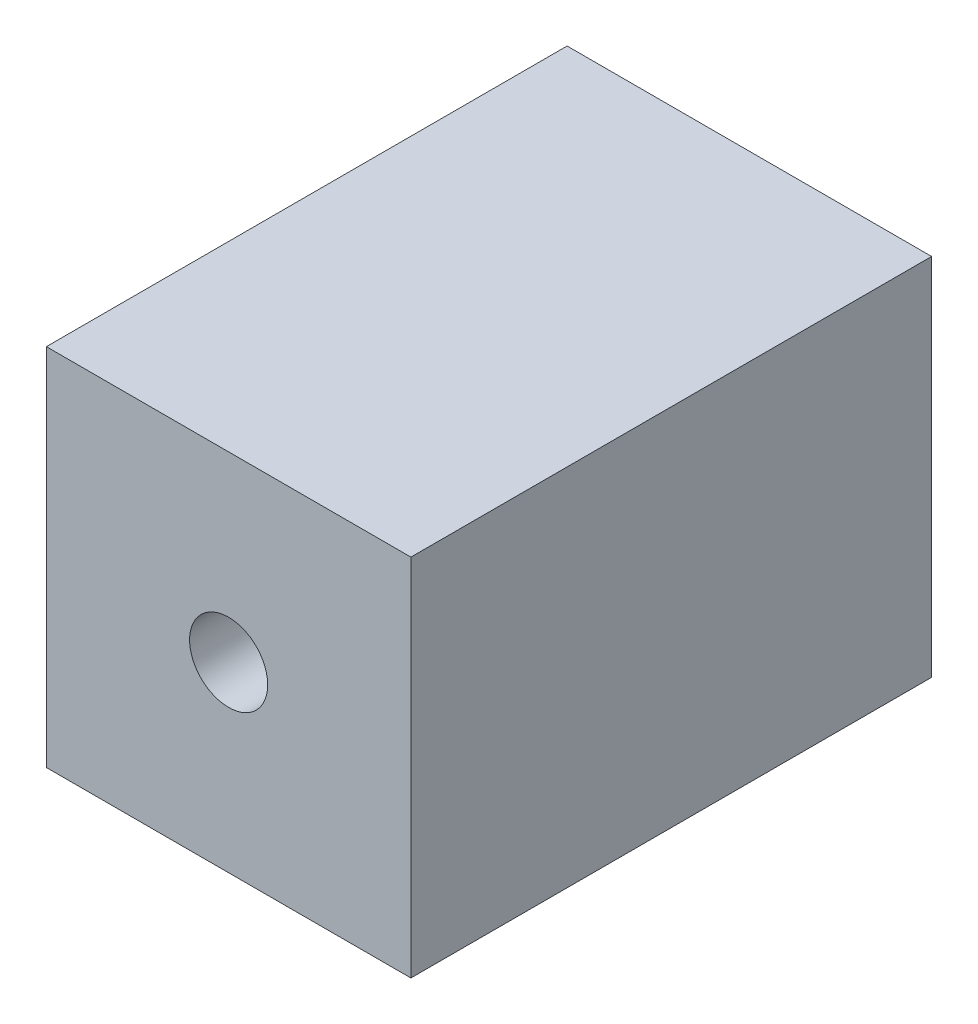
ISO-10303-21;
HEADER;
FILE_DESCRIPTION(('STEP AP214'),'2;1');
FILE_NAME('part.step','',(''),(''),'','','');
FILE_SCHEMA(('AUTOMOTIVE_DESIGN { 1 0 10303 214 1 1 1 1 }'));
ENDSEC;
DATA;
#1=APPLICATION_CONTEXT('core data for automotive mechanical design processes');
#2=APPLICATION_PROTOCOL_DEFINITION('international standard','automotive_design',2000,#1);
#3=PRODUCT_CONTEXT('',#1,'mechanical');
#4=PRODUCT('Part','Part','',(#3));
#5=PRODUCT_RELATED_PRODUCT_CATEGORY('part','',(#4));
#6=PRODUCT_DEFINITION_FORMATION('','',#4);
#7=PRODUCT_DEFINITION_CONTEXT('part definition',#1,'design');
#8=PRODUCT_DEFINITION('design','',#6,#7);
#9=PRODUCT_DEFINITION_SHAPE('','',#8);
#10=(LENGTH_UNIT() NAMED_UNIT(*) SI_UNIT(.MILLI.,.METRE.));
#11=(NAMED_UNIT(*) PLANE_ANGLE_UNIT() SI_UNIT($,.RADIAN.));
#12=(NAMED_UNIT(*) SI_UNIT($,.STERADIAN.) SOLID_ANGLE_UNIT());
#13=UNCERTAINTY_MEASURE_WITH_UNIT(LENGTH_MEASURE(1.E-05),#10,'distance_accuracy_value','');
#14=(GEOMETRIC_REPRESENTATION_CONTEXT(3) GLOBAL_UNCERTAINTY_ASSIGNED_CONTEXT((#13)) GLOBAL_UNIT_ASSIGNED_CONTEXT((#10,
#11,#12)) REPRESENTATION_CONTEXT('',''));
#15=CARTESIAN_POINT('',(0.,0.,0.));
#16=DIRECTION('',(0.,0.,1.));
#17=DIRECTION('',(1.,0.,0.));
#18=AXIS2_PLACEMENT_3D('',#15,#16,#17);
#19=CARTESIAN_POINT('',(0.,0.,40.));
#20=DIRECTION('',(0.,0.,-1.));
#21=DIRECTION('',(-1.,0.,0.));
#22=AXIS2_PLACEMENT_3D('',#19,#20,#21);
#23=PLANE('',#22);
#24=DIRECTION('',(0.,1.,0.));
#25=VECTOR('',#24,1.);
#26=CARTESIAN_POINT('',(14.,-14.,40.));
#27=LINE('',#26,#25);
#28=CARTESIAN_POINT('',(14.,-14.,40.));
#29=VERTEX_POINT('',#28);
#30=CARTESIAN_POINT('',(14.,14.,40.));
#31=VERTEX_POINT('',#30);
#32=EDGE_CURVE('E86',#29,#31,#27,.T.);
#33=ORIENTED_EDGE('',*,*,#32,.T.);
#34=DIRECTION('',(-1.,0.,0.));
#35=VECTOR('',#34,1.);
#36=CARTESIAN_POINT('',(-14.,14.,40.));
#37=LINE('',#36,#35);
#38=CARTESIAN_POINT('',(-14.,14.,40.));
#39=VERTEX_POINT('',#38);
#40=EDGE_CURVE('E81',#31,#39,#37,.T.);
#41=ORIENTED_EDGE('',*,*,#40,.T.);
#42=DIRECTION('',(0.,-1.,0.));
#43=VECTOR('',#42,1.);
#44=CARTESIAN_POINT('',(-14.,-14.,40.));
#45=LINE('',#44,#43);
#46=CARTESIAN_POINT('',(-14.,-14.,40.));
#47=VERTEX_POINT('',#46);
#48=EDGE_CURVE('E84',#39,#47,#45,.T.);
#49=ORIENTED_EDGE('',*,*,#48,.T.);
#50=DIRECTION('',(1.,0.,0.));
#51=VECTOR('',#50,1.);
#52=CARTESIAN_POINT('',(-14.,-14.,40.));
#53=LINE('',#52,#51);
#54=EDGE_CURVE('E51',#47,#29,#53,.T.);
#55=ORIENTED_EDGE('',*,*,#54,.T.);
#56=EDGE_LOOP('',(#33,#41,#49,#55));
#57=FACE_BOUND('',#56,.T.);
#58=CARTESIAN_POINT('',(0.,0.,40.));
#59=DIRECTION('',(0.,0.,1.));
#60=DIRECTION('',(1.,0.,0.));
#61=AXIS2_PLACEMENT_3D('',#58,#59,#60);
#62=CIRCLE('',#61,3.);
#63=CARTESIAN_POINT('',(3.,0.,40.));
#64=VERTEX_POINT('',#63);
#65=EDGE_CURVE('E101',#64,#64,#62,.T.);
#66=ORIENTED_EDGE('',*,*,#65,.F.);
#67=EDGE_LOOP('',(#66));
#68=FACE_BOUND('',#67,.T.);
#69=ADVANCED_FACE('F34',(#57,#68),#23,.F.);
#70=CARTESIAN_POINT('',(0.,0.,0.));
#71=DIRECTION('',(0.,0.,-1.));
#72=DIRECTION('',(-1.,0.,0.));
#73=AXIS2_PLACEMENT_3D('',#70,#71,#72);
#74=PLANE('',#73);
#75=DIRECTION('',(0.,1.,0.));
#76=VECTOR('',#75,1.);
#77=CARTESIAN_POINT('',(14.,-14.,0.));
#78=LINE('',#77,#76);
#79=CARTESIAN_POINT('',(14.,-14.,0.));
#80=VERTEX_POINT('',#79);
#81=CARTESIAN_POINT('',(14.,14.,0.));
#82=VERTEX_POINT('',#81);
#83=EDGE_CURVE('E98',#80,#82,#78,.T.);
#84=ORIENTED_EDGE('',*,*,#83,.F.);
#85=DIRECTION('',(1.,0.,0.));
#86=VECTOR('',#85,1.);
#87=CARTESIAN_POINT('',(-14.,-14.,0.));
#88=LINE('',#87,#86);
#89=CARTESIAN_POINT('',(-14.,-14.,0.));
#90=VERTEX_POINT('',#89);
#91=EDGE_CURVE('E74',#90,#80,#88,.T.);
#92=ORIENTED_EDGE('',*,*,#91,.F.);
#93=DIRECTION('',(0.,-1.,0.));
#94=VECTOR('',#93,1.);
#95=CARTESIAN_POINT('',(-14.,-14.,0.));
#96=LINE('',#95,#94);
#97=CARTESIAN_POINT('',(-14.,14.,0.));
#98=VERTEX_POINT('',#97);
#99=EDGE_CURVE('E68',#98,#90,#96,.T.);
#100=ORIENTED_EDGE('',*,*,#99,.F.);
#101=DIRECTION('',(-1.,0.,0.));
#102=VECTOR('',#101,1.);
#103=CARTESIAN_POINT('',(-14.,14.,0.));
#104=LINE('',#103,#102);
#105=EDGE_CURVE('E90',#82,#98,#104,.T.);
#106=ORIENTED_EDGE('',*,*,#105,.F.);
#107=EDGE_LOOP('',(#84,#92,#100,#106));
#108=FACE_BOUND('',#107,.T.);
#109=CARTESIAN_POINT('',(0.,0.,0.));
#110=DIRECTION('',(0.,0.,1.));
#111=DIRECTION('',(1.,0.,0.));
#112=AXIS2_PLACEMENT_3D('',#109,#110,#111);
#113=CIRCLE('',#112,3.);
#114=CARTESIAN_POINT('',(3.,0.,0.));
#115=VERTEX_POINT('',#114);
#116=EDGE_CURVE('E113',#115,#115,#113,.T.);
#117=ORIENTED_EDGE('',*,*,#116,.T.);
#118=EDGE_LOOP('',(#117));
#119=FACE_BOUND('',#118,.T.);
#120=ADVANCED_FACE('F109',(#108,#119),#74,.T.);
#121=CARTESIAN_POINT('',(14.,-14.,40.));
#122=DIRECTION('',(-1.,0.,0.));
#123=DIRECTION('',(0.,0.,1.));
#124=AXIS2_PLACEMENT_3D('',#121,#122,#123);
#125=PLANE('',#124);
#126=ORIENTED_EDGE('',*,*,#83,.T.);
#127=DIRECTION('',(0.,0.,-1.));
#128=VECTOR('',#127,1.);
#129=CARTESIAN_POINT('',(14.,14.,40.));
#130=LINE('',#129,#128);
#131=EDGE_CURVE('E11',#31,#82,#130,.T.);
#132=ORIENTED_EDGE('',*,*,#131,.F.);
#133=ORIENTED_EDGE('',*,*,#32,.F.);
#134=DIRECTION('',(0.,0.,-1.));
#135=VECTOR('',#134,1.);
#136=CARTESIAN_POINT('',(14.,-14.,40.));
#137=LINE('',#136,#135);
#138=EDGE_CURVE('E94',#29,#80,#137,.T.);
#139=ORIENTED_EDGE('',*,*,#138,.T.);
#140=EDGE_LOOP('',(#126,#132,#133,#139));
#141=FACE_BOUND('',#140,.T.);
#142=ADVANCED_FACE('F36',(#141),#125,.F.);
#143=CARTESIAN_POINT('',(-14.,14.,40.));
#144=DIRECTION('',(0.,-1.,0.));
#145=DIRECTION('',(0.,0.,-1.));
#146=AXIS2_PLACEMENT_3D('',#143,#144,#145);
#147=PLANE('',#146);
#148=ORIENTED_EDGE('',*,*,#105,.T.);
#149=DIRECTION('',(0.,0.,-1.));
#150=VECTOR('',#149,1.);
#151=CARTESIAN_POINT('',(-14.,14.,40.));
#152=LINE('',#151,#150);
#153=EDGE_CURVE('E43',#39,#98,#152,.T.);
#154=ORIENTED_EDGE('',*,*,#153,.F.);
#155=ORIENTED_EDGE('',*,*,#40,.F.);
#156=ORIENTED_EDGE('',*,*,#131,.T.);
#157=EDGE_LOOP('',(#148,#154,#155,#156));
#158=FACE_BOUND('',#157,.T.);
#159=ADVANCED_FACE('F89',(#158),#147,.F.);
#160=CARTESIAN_POINT('',(-14.,-14.,40.));
#161=DIRECTION('',(1.,0.,0.));
#162=DIRECTION('',(0.,0.,-1.));
#163=AXIS2_PLACEMENT_3D('',#160,#161,#162);
#164=PLANE('',#163);
#165=ORIENTED_EDGE('',*,*,#99,.T.);
#166=DIRECTION('',(0.,0.,-1.));
#167=VECTOR('',#166,1.);
#168=CARTESIAN_POINT('',(-14.,-14.,40.));
#169=LINE('',#168,#167);
#170=EDGE_CURVE('E91',#47,#90,#169,.T.);
#171=ORIENTED_EDGE('',*,*,#170,.F.);
#172=ORIENTED_EDGE('',*,*,#48,.F.);
#173=ORIENTED_EDGE('',*,*,#153,.T.);
#174=EDGE_LOOP('',(#165,#171,#172,#173));
#175=FACE_BOUND('',#174,.T.);
#176=ADVANCED_FACE('F92',(#175),#164,.F.);
#177=CARTESIAN_POINT('',(-14.,-14.,40.));
#178=DIRECTION('',(0.,1.,0.));
#179=DIRECTION('',(0.,0.,1.));
#180=AXIS2_PLACEMENT_3D('',#177,#178,#179);
#181=PLANE('',#180);
#182=ORIENTED_EDGE('',*,*,#91,.T.);
#183=ORIENTED_EDGE('',*,*,#138,.F.);
#184=ORIENTED_EDGE('',*,*,#54,.F.);
#185=ORIENTED_EDGE('',*,*,#170,.T.);
#186=EDGE_LOOP('',(#182,#183,#184,#185));
#187=FACE_BOUND('',#186,.T.);
#188=ADVANCED_FACE('F106',(#187),#181,.F.);
#189=CARTESIAN_POINT('',(0.,0.,40.));
#190=DIRECTION('',(0.,0.,-1.));
#191=DIRECTION('',(-1.,0.,0.));
#192=AXIS2_PLACEMENT_3D('',#189,#190,#191);
#193=CYLINDRICAL_SURFACE('',#192,3.);
#194=ORIENTED_EDGE('',*,*,#65,.T.);
#195=EDGE_LOOP('',(#194));
#196=FACE_BOUND('',#195,.T.);
#197=ORIENTED_EDGE('',*,*,#116,.F.);
#198=EDGE_LOOP('',(#197));
#199=FACE_BOUND('',#198,.T.);
#200=ADVANCED_FACE('F119',(#196,#199),#193,.F.);
#201=CLOSED_SHELL('',(#69,#120,#142,#159,#176,#188,#200));
#202=MANIFOLD_SOLID_BREP('B2',#201);
#203=ADVANCED_BREP_SHAPE_REPRESENTATION('',(#18,#202),#14);
#204=SHAPE_DEFINITION_REPRESENTATION(#9,#203);
ENDSEC;
END-ISO-10303-21;
